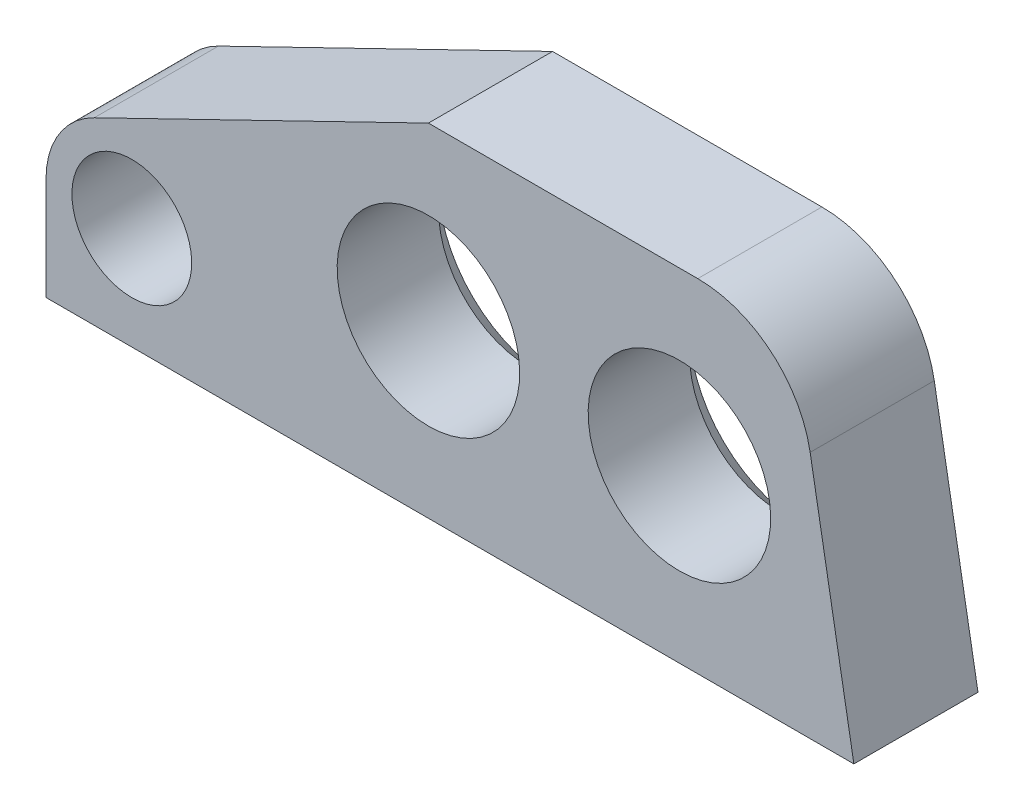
ISO-10303-21;
HEADER;
FILE_DESCRIPTION(('STEP AP214'),'2;1');
FILE_NAME('part.step','',(''),(''),'','','');
FILE_SCHEMA(('AUTOMOTIVE_DESIGN { 1 0 10303 214 1 1 1 1 }'));
ENDSEC;
DATA;
#1=APPLICATION_CONTEXT('core data for automotive mechanical design processes');
#2=APPLICATION_PROTOCOL_DEFINITION('international standard','automotive_design',2000,#1);
#3=PRODUCT_CONTEXT('',#1,'mechanical');
#4=PRODUCT('Part','Part','',(#3));
#5=PRODUCT_RELATED_PRODUCT_CATEGORY('part','',(#4));
#6=PRODUCT_DEFINITION_FORMATION('','',#4);
#7=PRODUCT_DEFINITION_CONTEXT('part definition',#1,'design');
#8=PRODUCT_DEFINITION('design','',#6,#7);
#9=PRODUCT_DEFINITION_SHAPE('','',#8);
#10=(LENGTH_UNIT() NAMED_UNIT(*) SI_UNIT(.MILLI.,.METRE.));
#11=(NAMED_UNIT(*) PLANE_ANGLE_UNIT() SI_UNIT($,.RADIAN.));
#12=(NAMED_UNIT(*) SI_UNIT($,.STERADIAN.) SOLID_ANGLE_UNIT());
#13=UNCERTAINTY_MEASURE_WITH_UNIT(LENGTH_MEASURE(1.E-05),#10,'distance_accuracy_value','');
#14=(GEOMETRIC_REPRESENTATION_CONTEXT(3) GLOBAL_UNCERTAINTY_ASSIGNED_CONTEXT((#13)) GLOBAL_UNIT_ASSIGNED_CONTEXT((#10,
#11,#12)) REPRESENTATION_CONTEXT('',''));
#15=CARTESIAN_POINT('',(0.,0.,0.));
#16=DIRECTION('',(0.,0.,1.));
#17=DIRECTION('',(1.,0.,0.));
#18=AXIS2_PLACEMENT_3D('',#15,#16,#17);
#19=CARTESIAN_POINT('',(74.2278597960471,40.077559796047,24.8412));
#20=DIRECTION('',(-1.,0.,0.));
#21=DIRECTION('',(0.,0.,1.));
#22=AXIS2_PLACEMENT_3D('',#19,#20,#21);
#23=PLANE('',#22);
#24=DIRECTION('',(0.,1.,0.));
#25=VECTOR('',#24,1.);
#26=CARTESIAN_POINT('',(74.2278597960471,34.362559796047,-6.35));
#27=LINE('',#26,#25);
#28=CARTESIAN_POINT('',(74.2278597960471,34.362559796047,-6.35));
#29=VERTEX_POINT('',#28);
#30=CARTESIAN_POINT('',(74.2278597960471,40.077559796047,-6.34999999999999));
#31=VERTEX_POINT('',#30);
#32=EDGE_CURVE('E298',#29,#31,#27,.T.);
#33=ORIENTED_EDGE('',*,*,#32,.T.);
#34=DIRECTION('',(0.,0.,1.));
#35=VECTOR('',#34,1.);
#36=CARTESIAN_POINT('',(74.2278597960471,40.077559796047,-38.3761637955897));
#37=LINE('',#36,#35);
#38=CARTESIAN_POINT('',(74.2278597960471,40.077559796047,-13.2588));
#39=VERTEX_POINT('',#38);
#40=EDGE_CURVE('E239',#39,#31,#37,.T.);
#41=ORIENTED_EDGE('',*,*,#40,.F.);
#42=DIRECTION('',(0.,1.,0.));
#43=VECTOR('',#42,1.);
#44=CARTESIAN_POINT('',(74.2278597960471,40.077559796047,-13.2588));
#45=LINE('',#44,#43);
#46=CARTESIAN_POINT('',(74.2278597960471,34.362559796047,-13.2588));
#47=VERTEX_POINT('',#46);
#48=EDGE_CURVE('E284',#47,#39,#45,.T.);
#49=ORIENTED_EDGE('',*,*,#48,.F.);
#50=DIRECTION('',(0.,0.,-1.));
#51=VECTOR('',#50,1.);
#52=CARTESIAN_POINT('',(74.2278597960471,34.362559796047,24.8412));
#53=LINE('',#52,#51);
#54=EDGE_CURVE('E295',#29,#47,#53,.T.);
#55=ORIENTED_EDGE('',*,*,#54,.F.);
#56=EDGE_LOOP('',(#33,#41,#49,#55));
#57=FACE_BOUND('',#56,.T.);
#58=ADVANCED_FACE('F164',(#57),#23,.T.);
#59=CARTESIAN_POINT('',(142.187879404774,34.3625597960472,-13.2588));
#60=DIRECTION('',(0.,0.,1.));
#61=DIRECTION('',(0.,1.,0.));
#62=AXIS2_PLACEMENT_3D('',#59,#60,#61);
#63=PLANE('',#62);
#64=CARTESIAN_POINT('',(79.0030597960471,40.077559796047,-13.2588));
#65=DIRECTION('',(0.,0.,-1.));
#66=DIRECTION('',(0.,-1.,0.));
#67=AXIS2_PLACEMENT_3D('',#64,#65,#66);
#68=CIRCLE('',#67,3.33375);
#69=CARTESIAN_POINT('',(79.0030597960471,36.743809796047,-13.2588));
#70=VERTEX_POINT('',#69);
#71=EDGE_CURVE('E329',#70,#70,#68,.T.);
#72=ORIENTED_EDGE('',*,*,#71,.F.);
#73=EDGE_LOOP('',(#72));
#74=FACE_BOUND('',#73,.T.);
#75=CARTESIAN_POINT('',(95.5130597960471,43.8875597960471,-13.2588));
#76=DIRECTION('',(0.,0.,-1.));
#77=DIRECTION('',(0.,-1.,0.));
#78=AXIS2_PLACEMENT_3D('',#75,#76,#77);
#79=CIRCLE('',#78,6.35);
#80=CARTESIAN_POINT('',(95.5130597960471,37.5375597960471,-13.2588));
#81=VERTEX_POINT('',#80);
#82=EDGE_CURVE('E274',#81,#81,#79,.T.);
#83=ORIENTED_EDGE('',*,*,#82,.F.);
#84=EDGE_LOOP('',(#83));
#85=FACE_BOUND('',#84,.T.);
#86=CARTESIAN_POINT('',(109.483059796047,43.8875597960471,-13.2588));
#87=DIRECTION('',(0.,0.,-1.));
#88=DIRECTION('',(0.,-1.,0.));
#89=AXIS2_PLACEMENT_3D('',#86,#87,#88);
#90=CIRCLE('',#89,6.35);
#91=CARTESIAN_POINT('',(109.483059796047,37.5375597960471,-13.2588));
#92=VERTEX_POINT('',#91);
#93=EDGE_CURVE('E273',#92,#92,#90,.T.);
#94=ORIENTED_EDGE('',*,*,#93,.F.);
#95=EDGE_LOOP('',(#94));
#96=FACE_BOUND('',#95,.T.);
#97=DIRECTION('',(1.,0.,0.));
#98=VECTOR('',#97,1.);
#99=CARTESIAN_POINT('',(115.834111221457,53.4125597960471,-13.2588));
#100=LINE('',#99,#98);
#101=CARTESIAN_POINT('',(95.513059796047,53.4125597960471,-13.2588));
#102=VERTEX_POINT('',#101);
#103=CARTESIAN_POINT('',(110.505828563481,53.4125597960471,-13.2588));
#104=VERTEX_POINT('',#103);
#105=EDGE_CURVE('E286',#102,#104,#100,.T.);
#106=ORIENTED_EDGE('',*,*,#105,.T.);
#107=CARTESIAN_POINT('',(110.505828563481,47.0625597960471,-13.2588));
#108=DIRECTION('',(0.,0.,1.));
#109=DIRECTION('',(0.,1.,0.));
#110=AXIS2_PLACEMENT_3D('',#107,#108,#109);
#111=CIRCLE('',#110,6.35);
#112=CARTESIAN_POINT('',(116.759357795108,48.1652257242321,-13.2588));
#113=VERTEX_POINT('',#112);
#114=EDGE_CURVE('E187',#104,#113,#111,.F.);
#115=ORIENTED_EDGE('',*,*,#114,.T.);
#116=DIRECTION('',(0.173648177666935,-0.984807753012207,0.));
#117=VECTOR('',#116,1.);
#118=CARTESIAN_POINT('',(119.193140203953,34.3625597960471,-13.2588));
#119=LINE('',#118,#117);
#120=CARTESIAN_POINT('',(119.193140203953,34.3625597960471,-13.2588));
#121=VERTEX_POINT('',#120);
#122=EDGE_CURVE('E285',#113,#121,#119,.T.);
#123=ORIENTED_EDGE('',*,*,#122,.T.);
#124=DIRECTION('',(-1.,0.,0.));
#125=VECTOR('',#124,1.);
#126=CARTESIAN_POINT('',(142.187879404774,34.3625597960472,-13.2588));
#127=LINE('',#126,#125);
#128=EDGE_CURVE('E301',#121,#47,#127,.T.);
#129=ORIENTED_EDGE('',*,*,#128,.T.);
#130=ORIENTED_EDGE('',*,*,#48,.T.);
#131=CARTESIAN_POINT('',(79.0030597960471,40.077559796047,-13.2588));
#132=DIRECTION('',(0.,0.,1.));
#133=DIRECTION('',(0.,1.,0.));
#134=AXIS2_PLACEMENT_3D('',#131,#132,#133);
#135=CIRCLE('',#134,4.77520000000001);
#136=CARTESIAN_POINT('',(76.9154148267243,44.3722394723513,-13.2588));
#137=VERTEX_POINT('',#136);
#138=EDGE_CURVE('E257',#137,#39,#135,.T.);
#139=ORIENTED_EDGE('',*,*,#138,.F.);
#140=DIRECTION('',(-0.899371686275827,-0.437184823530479,0.));
#141=VECTOR('',#140,1.);
#142=CARTESIAN_POINT('',(76.9154148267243,44.3722394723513,-13.2588));
#143=LINE('',#142,#141);
#144=EDGE_CURVE('E229',#102,#137,#143,.T.);
#145=ORIENTED_EDGE('',*,*,#144,.F.);
#146=EDGE_LOOP('',(#106,#115,#123,#129,#130,#139,#145));
#147=FACE_BOUND('',#146,.T.);
#148=ADVANCED_FACE('F336',(#74,#85,#96,#147),#63,.F.);
#149=CARTESIAN_POINT('',(115.834111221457,53.4125597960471,0.));
#150=DIRECTION('',(-0.984807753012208,-0.173648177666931,0.));
#151=DIRECTION('',(0.,0.,-1.));
#152=AXIS2_PLACEMENT_3D('',#149,#150,#151);
#153=PLANE('',#152);
#154=ORIENTED_EDGE('',*,*,#122,.F.);
#155=DIRECTION('',(0.,0.,-1.));
#156=VECTOR('',#155,1.);
#157=CARTESIAN_POINT('',(116.759357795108,48.1652257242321,-6.35));
#158=LINE('',#157,#156);
#159=CARTESIAN_POINT('',(116.759357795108,48.1652257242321,-6.35));
#160=VERTEX_POINT('',#159);
#161=EDGE_CURVE('E173',#113,#160,#158,.F.);
#162=ORIENTED_EDGE('',*,*,#161,.T.);
#163=DIRECTION('',(0.173648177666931,-0.984807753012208,0.));
#164=VECTOR('',#163,1.);
#165=CARTESIAN_POINT('',(115.834111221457,53.4125597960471,-6.35));
#166=LINE('',#165,#164);
#167=CARTESIAN_POINT('',(119.193140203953,34.3625597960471,-6.35));
#168=VERTEX_POINT('',#167);
#169=EDGE_CURVE('E262',#168,#160,#166,.F.);
#170=ORIENTED_EDGE('',*,*,#169,.F.);
#171=DIRECTION('',(0.,0.,1.));
#172=VECTOR('',#171,1.);
#173=CARTESIAN_POINT('',(119.193140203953,34.3625597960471,-13.2588));
#174=LINE('',#173,#172);
#175=EDGE_CURVE('E308',#168,#121,#174,.F.);
#176=ORIENTED_EDGE('',*,*,#175,.T.);
#177=EDGE_LOOP('',(#154,#162,#170,#176));
#178=FACE_BOUND('',#177,.T.);
#179=ADVANCED_FACE('F339',(#178),#153,.F.);
#180=CARTESIAN_POINT('',(142.187879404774,34.3625597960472,-6.35));
#181=DIRECTION('',(0.,0.,-1.));
#182=DIRECTION('',(0.,-1.,0.));
#183=AXIS2_PLACEMENT_3D('',#180,#181,#182);
#184=PLANE('',#183);
#185=CARTESIAN_POINT('',(79.0030597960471,40.077559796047,-6.35));
#186=DIRECTION('',(0.,0.,-1.));
#187=DIRECTION('',(0.,-1.,0.));
#188=AXIS2_PLACEMENT_3D('',#185,#186,#187);
#189=CIRCLE('',#188,3.33375);
#190=CARTESIAN_POINT('',(79.0030597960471,36.743809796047,-6.35));
#191=VERTEX_POINT('',#190);
#192=EDGE_CURVE('E244',#191,#191,#189,.F.);
#193=ORIENTED_EDGE('',*,*,#192,.F.);
#194=EDGE_LOOP('',(#193));
#195=FACE_BOUND('',#194,.T.);
#196=ORIENTED_EDGE('',*,*,#169,.T.);
#197=CARTESIAN_POINT('',(110.505828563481,47.0625597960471,-6.35));
#198=DIRECTION('',(0.,0.,-1.));
#199=DIRECTION('',(0.,-1.,0.));
#200=AXIS2_PLACEMENT_3D('',#197,#198,#199);
#201=CIRCLE('',#200,6.35);
#202=CARTESIAN_POINT('',(110.505828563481,53.4125597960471,-6.35));
#203=VERTEX_POINT('',#202);
#204=EDGE_CURVE('E13',#160,#203,#201,.F.);
#205=ORIENTED_EDGE('',*,*,#204,.T.);
#206=DIRECTION('',(1.,0.,0.));
#207=VECTOR('',#206,1.);
#208=CARTESIAN_POINT('',(115.834111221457,53.4125597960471,-6.35));
#209=LINE('',#208,#207);
#210=CARTESIAN_POINT('',(95.513059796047,53.4125597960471,-6.34999999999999));
#211=VERTEX_POINT('',#210);
#212=EDGE_CURVE('E250',#211,#203,#209,.T.);
#213=ORIENTED_EDGE('',*,*,#212,.F.);
#214=DIRECTION('',(0.899371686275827,0.437184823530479,0.));
#215=VECTOR('',#214,1.);
#216=CARTESIAN_POINT('',(76.9154148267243,44.3722394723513,-6.34999999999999));
#217=LINE('',#216,#215);
#218=CARTESIAN_POINT('',(76.9154148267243,44.3722394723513,-6.34999999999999));
#219=VERTEX_POINT('',#218);
#220=EDGE_CURVE('E226',#219,#211,#217,.T.);
#221=ORIENTED_EDGE('',*,*,#220,.F.);
#222=CARTESIAN_POINT('',(79.0030597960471,40.077559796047,-6.34999999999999));
#223=DIRECTION('',(0.,0.,-1.));
#224=DIRECTION('',(0.,-1.,0.));
#225=AXIS2_PLACEMENT_3D('',#222,#223,#224);
#226=CIRCLE('',#225,4.77520000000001);
#227=EDGE_CURVE('E236',#31,#219,#226,.T.);
#228=ORIENTED_EDGE('',*,*,#227,.F.);
#229=ORIENTED_EDGE('',*,*,#32,.F.);
#230=DIRECTION('',(-1.,0.,0.));
#231=VECTOR('',#230,1.);
#232=CARTESIAN_POINT('',(142.187879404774,34.3625597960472,-6.35));
#233=LINE('',#232,#231);
#234=EDGE_CURVE('E305',#168,#29,#233,.T.);
#235=ORIENTED_EDGE('',*,*,#234,.F.);
#236=EDGE_LOOP('',(#196,#205,#213,#221,#228,#229,#235));
#237=FACE_BOUND('',#236,.T.);
#238=CARTESIAN_POINT('',(95.5130597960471,43.8875597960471,-6.35));
#239=DIRECTION('',(0.,0.,-1.));
#240=DIRECTION('',(0.,-1.,0.));
#241=AXIS2_PLACEMENT_3D('',#238,#239,#240);
#242=CIRCLE('',#241,5.08000000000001);
#243=CARTESIAN_POINT('',(95.5130597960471,38.8075597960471,-6.35));
#244=VERTEX_POINT('',#243);
#245=EDGE_CURVE('E265',#244,#244,#242,.F.);
#246=ORIENTED_EDGE('',*,*,#245,.F.);
#247=EDGE_LOOP('',(#246));
#248=FACE_BOUND('',#247,.T.);
#249=CARTESIAN_POINT('',(109.483059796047,43.8875597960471,-6.35));
#250=DIRECTION('',(0.,0.,-1.));
#251=DIRECTION('',(0.,-1.,0.));
#252=AXIS2_PLACEMENT_3D('',#249,#250,#251);
#253=CIRCLE('',#252,5.08000000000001);
#254=CARTESIAN_POINT('',(109.483059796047,38.8075597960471,-6.35));
#255=VERTEX_POINT('',#254);
#256=EDGE_CURVE('E269',#255,#255,#253,.F.);
#257=ORIENTED_EDGE('',*,*,#256,.F.);
#258=EDGE_LOOP('',(#257));
#259=FACE_BOUND('',#258,.T.);
#260=ADVANCED_FACE('F247',(#195,#237,#248,#259),#184,.F.);
#261=CARTESIAN_POINT('',(140.598059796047,53.4125597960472,0.));
#262=DIRECTION('',(0.,-1.,0.));
#263=DIRECTION('',(0.,0.,1.));
#264=AXIS2_PLACEMENT_3D('',#261,#262,#263);
#265=PLANE('',#264);
#266=ORIENTED_EDGE('',*,*,#212,.T.);
#267=DIRECTION('',(0.,0.,1.));
#268=VECTOR('',#267,1.);
#269=CARTESIAN_POINT('',(110.505828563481,53.4125597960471,-13.2588));
#270=LINE('',#269,#268);
#271=EDGE_CURVE('E312',#203,#104,#270,.F.);
#272=ORIENTED_EDGE('',*,*,#271,.T.);
#273=ORIENTED_EDGE('',*,*,#105,.F.);
#274=DIRECTION('',(0.,0.,1.));
#275=VECTOR('',#274,1.);
#276=CARTESIAN_POINT('',(95.513059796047,53.4125597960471,-38.3761637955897));
#277=LINE('',#276,#275);
#278=EDGE_CURVE('E233',#102,#211,#277,.T.);
#279=ORIENTED_EDGE('',*,*,#278,.T.);
#280=EDGE_LOOP('',(#266,#272,#273,#279));
#281=FACE_BOUND('',#280,.T.);
#282=ADVANCED_FACE('F346',(#281),#265,.F.);
#283=CARTESIAN_POINT('',(95.5130597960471,43.8875597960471,-11.9888));
#284=DIRECTION('',(0.,0.,-1.));
#285=DIRECTION('',(0.,-1.,0.));
#286=AXIS2_PLACEMENT_3D('',#283,#284,#285);
#287=CONICAL_SURFACE('',#286,5.08000000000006,0.785398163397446);
#288=ORIENTED_EDGE('',*,*,#82,.T.);
#289=EDGE_LOOP('',(#288));
#290=FACE_BOUND('',#289,.T.);
#291=CARTESIAN_POINT('',(95.5130597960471,43.8875597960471,-11.9888));
#292=DIRECTION('',(0.,0.,-1.));
#293=DIRECTION('',(0.,-1.,0.));
#294=AXIS2_PLACEMENT_3D('',#291,#292,#293);
#295=CIRCLE('',#294,5.08000000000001);
#296=CARTESIAN_POINT('',(95.5130597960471,38.8075597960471,-11.9888));
#297=VERTEX_POINT('',#296);
#298=EDGE_CURVE('E289',#297,#297,#295,.F.);
#299=ORIENTED_EDGE('',*,*,#298,.T.);
#300=EDGE_LOOP('',(#299));
#301=FACE_BOUND('',#300,.T.);
#302=ADVANCED_FACE('F374',(#290,#301),#287,.F.);
#303=CARTESIAN_POINT('',(95.5130597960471,43.8875597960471,57.404));
#304=DIRECTION('',(0.,0.,-1.));
#305=DIRECTION('',(-1.,0.,0.));
#306=AXIS2_PLACEMENT_3D('',#303,#304,#305);
#307=CYLINDRICAL_SURFACE('',#306,5.08000000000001);
#308=ORIENTED_EDGE('',*,*,#245,.T.);
#309=EDGE_LOOP('',(#308));
#310=FACE_BOUND('',#309,.T.);
#311=ORIENTED_EDGE('',*,*,#298,.F.);
#312=EDGE_LOOP('',(#311));
#313=FACE_BOUND('',#312,.T.);
#314=ADVANCED_FACE('F372',(#310,#313),#307,.F.);
#315=CARTESIAN_POINT('',(109.483059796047,43.8875597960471,-11.9888));
#316=DIRECTION('',(0.,0.,-1.));
#317=DIRECTION('',(0.,-1.,0.));
#318=AXIS2_PLACEMENT_3D('',#315,#316,#317);
#319=CONICAL_SURFACE('',#318,5.08000000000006,0.785398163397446);
#320=ORIENTED_EDGE('',*,*,#93,.T.);
#321=EDGE_LOOP('',(#320));
#322=FACE_BOUND('',#321,.T.);
#323=CARTESIAN_POINT('',(109.483059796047,43.8875597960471,-11.9888));
#324=DIRECTION('',(0.,0.,-1.));
#325=DIRECTION('',(0.,-1.,0.));
#326=AXIS2_PLACEMENT_3D('',#323,#324,#325);
#327=CIRCLE('',#326,5.08000000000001);
#328=CARTESIAN_POINT('',(109.483059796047,38.8075597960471,-11.9888));
#329=VERTEX_POINT('',#328);
#330=EDGE_CURVE('E278',#329,#329,#327,.F.);
#331=ORIENTED_EDGE('',*,*,#330,.T.);
#332=EDGE_LOOP('',(#331));
#333=FACE_BOUND('',#332,.T.);
#334=ADVANCED_FACE('F369',(#322,#333),#319,.F.);
#335=CARTESIAN_POINT('',(109.483059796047,43.8875597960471,57.404));
#336=DIRECTION('',(0.,0.,-1.));
#337=DIRECTION('',(-1.,0.,0.));
#338=AXIS2_PLACEMENT_3D('',#335,#336,#337);
#339=CYLINDRICAL_SURFACE('',#338,5.08000000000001);
#340=ORIENTED_EDGE('',*,*,#256,.T.);
#341=EDGE_LOOP('',(#340));
#342=FACE_BOUND('',#341,.T.);
#343=ORIENTED_EDGE('',*,*,#330,.F.);
#344=EDGE_LOOP('',(#343));
#345=FACE_BOUND('',#344,.T.);
#346=ADVANCED_FACE('F371',(#342,#345),#339,.F.);
#347=CARTESIAN_POINT('',(139.015822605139,34.3625597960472,-6.35));
#348=DIRECTION('',(0.,1.,0.));
#349=DIRECTION('',(0.,0.,-1.));
#350=AXIS2_PLACEMENT_3D('',#347,#348,#349);
#351=PLANE('',#350);
#352=ORIENTED_EDGE('',*,*,#54,.T.);
#353=ORIENTED_EDGE('',*,*,#128,.F.);
#354=ORIENTED_EDGE('',*,*,#175,.F.);
#355=ORIENTED_EDGE('',*,*,#234,.T.);
#356=EDGE_LOOP('',(#352,#353,#354,#355));
#357=FACE_BOUND('',#356,.T.);
#358=ADVANCED_FACE('F353',(#357),#351,.F.);
#359=CARTESIAN_POINT('',(79.0030597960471,40.077559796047,-38.3761637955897));
#360=DIRECTION('',(0.,0.,1.));
#361=DIRECTION('',(0.,1.,0.));
#362=AXIS2_PLACEMENT_3D('',#359,#360,#361);
#363=CYLINDRICAL_SURFACE('',#362,4.77520000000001);
#364=ORIENTED_EDGE('',*,*,#138,.T.);
#365=ORIENTED_EDGE('',*,*,#40,.T.);
#366=ORIENTED_EDGE('',*,*,#227,.T.);
#367=DIRECTION('',(0.,0.,1.));
#368=VECTOR('',#367,1.);
#369=CARTESIAN_POINT('',(76.9154148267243,44.3722394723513,-38.3761637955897));
#370=LINE('',#369,#368);
#371=EDGE_CURVE('E222',#137,#219,#370,.T.);
#372=ORIENTED_EDGE('',*,*,#371,.F.);
#373=EDGE_LOOP('',(#364,#365,#366,#372));
#374=FACE_BOUND('',#373,.T.);
#375=ADVANCED_FACE('F237',(#374),#363,.T.);
#376=CARTESIAN_POINT('',(76.9154148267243,44.3722394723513,-38.3761637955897));
#377=DIRECTION('',(0.437184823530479,-0.899371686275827,0.));
#378=DIRECTION('',(0.899371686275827,0.437184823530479,0.));
#379=AXIS2_PLACEMENT_3D('',#376,#377,#378);
#380=PLANE('',#379);
#381=ORIENTED_EDGE('',*,*,#144,.T.);
#382=ORIENTED_EDGE('',*,*,#371,.T.);
#383=ORIENTED_EDGE('',*,*,#220,.T.);
#384=ORIENTED_EDGE('',*,*,#278,.F.);
#385=EDGE_LOOP('',(#381,#382,#383,#384));
#386=FACE_BOUND('',#385,.T.);
#387=ADVANCED_FACE('F224',(#386),#380,.F.);
#388=CARTESIAN_POINT('',(110.505828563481,47.0625597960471,0.));
#389=DIRECTION('',(0.,0.,-1.));
#390=DIRECTION('',(0.,-1.,0.));
#391=AXIS2_PLACEMENT_3D('',#388,#389,#390);
#392=CYLINDRICAL_SURFACE('',#391,6.35);
#393=ORIENTED_EDGE('',*,*,#204,.F.);
#394=ORIENTED_EDGE('',*,*,#161,.F.);
#395=ORIENTED_EDGE('',*,*,#114,.F.);
#396=ORIENTED_EDGE('',*,*,#271,.F.);
#397=EDGE_LOOP('',(#393,#394,#395,#396));
#398=FACE_BOUND('',#397,.T.);
#399=ADVANCED_FACE('F166',(#398),#392,.T.);
#400=CARTESIAN_POINT('',(79.0030597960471,40.077559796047,3.07926892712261));
#401=DIRECTION('',(0.,0.,-1.));
#402=DIRECTION('',(0.,-1.,0.));
#403=AXIS2_PLACEMENT_3D('',#400,#401,#402);
#404=CYLINDRICAL_SURFACE('',#403,3.33375);
#405=ORIENTED_EDGE('',*,*,#192,.T.);
#406=EDGE_LOOP('',(#405));
#407=FACE_BOUND('',#406,.T.);
#408=ORIENTED_EDGE('',*,*,#71,.T.);
#409=EDGE_LOOP('',(#408));
#410=FACE_BOUND('',#409,.T.);
#411=ADVANCED_FACE('F334',(#407,#410),#404,.F.);
#412=CLOSED_SHELL('',(#58,#148,#179,#260,#282,#302,#314,#334,#346,#358,#375,#387,#399,#411));
#413=MANIFOLD_SOLID_BREP('B2',#412);
#414=ADVANCED_BREP_SHAPE_REPRESENTATION('',(#18,#413),#14);
#415=SHAPE_DEFINITION_REPRESENTATION(#9,#414);
ENDSEC;
END-ISO-10303-21;
